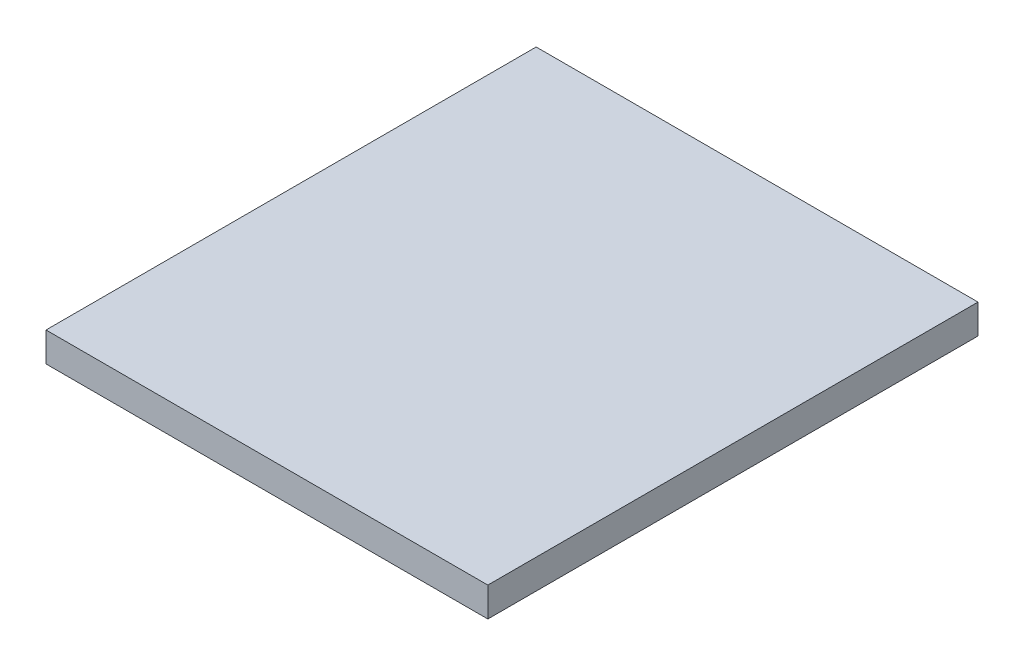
ISO-10303-21;
HEADER;
FILE_DESCRIPTION(('STEP AP214'),'2;1');
FILE_NAME('part.step','',(''),(''),'','','');
FILE_SCHEMA(('AUTOMOTIVE_DESIGN { 1 0 10303 214 1 1 1 1 }'));
ENDSEC;
DATA;
#1=APPLICATION_CONTEXT('core data for automotive mechanical design processes');
#2=APPLICATION_PROTOCOL_DEFINITION('international standard','automotive_design',2000,#1);
#3=PRODUCT_CONTEXT('',#1,'mechanical');
#4=PRODUCT('Part','Part','',(#3));
#5=PRODUCT_RELATED_PRODUCT_CATEGORY('part','',(#4));
#6=PRODUCT_DEFINITION_FORMATION('','',#4);
#7=PRODUCT_DEFINITION_CONTEXT('part definition',#1,'design');
#8=PRODUCT_DEFINITION('design','',#6,#7);
#9=PRODUCT_DEFINITION_SHAPE('','',#8);
#10=(LENGTH_UNIT() NAMED_UNIT(*) SI_UNIT(.MILLI.,.METRE.));
#11=(NAMED_UNIT(*) PLANE_ANGLE_UNIT() SI_UNIT($,.RADIAN.));
#12=(NAMED_UNIT(*) SI_UNIT($,.STERADIAN.) SOLID_ANGLE_UNIT());
#13=UNCERTAINTY_MEASURE_WITH_UNIT(LENGTH_MEASURE(1.E-05),#10,'distance_accuracy_value','');
#14=(GEOMETRIC_REPRESENTATION_CONTEXT(3) GLOBAL_UNCERTAINTY_ASSIGNED_CONTEXT((#13)) GLOBAL_UNIT_ASSIGNED_CONTEXT((#10,
#11,#12)) REPRESENTATION_CONTEXT('',''));
#15=CARTESIAN_POINT('',(0.,0.,0.));
#16=DIRECTION('',(0.,0.,1.));
#17=DIRECTION('',(1.,0.,0.));
#18=AXIS2_PLACEMENT_3D('',#15,#16,#17);
#19=CARTESIAN_POINT('',(1.93141652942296,6.,50.));
#20=DIRECTION('',(0.,0.,1.));
#21=DIRECTION('',(0.,1.,0.));
#22=AXIS2_PLACEMENT_3D('',#19,#20,#21);
#23=PLANE('',#22);
#24=DIRECTION('',(1.,0.,0.));
#25=VECTOR('',#24,1.);
#26=CARTESIAN_POINT('',(-20.068583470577,0.,50.));
#27=LINE('',#26,#25);
#28=CARTESIAN_POINT('',(-20.068583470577,0.,50.));
#29=VERTEX_POINT('',#28);
#30=CARTESIAN_POINT('',(25.,0.,50.));
#31=VERTEX_POINT('',#30);
#32=EDGE_CURVE('E67',#29,#31,#27,.T.);
#33=ORIENTED_EDGE('',*,*,#32,.T.);
#34=DIRECTION('',(0.,-1.,0.));
#35=VECTOR('',#34,1.);
#36=CARTESIAN_POINT('',(25.,3.,50.));
#37=LINE('',#36,#35);
#38=CARTESIAN_POINT('',(25.,3.,50.));
#39=VERTEX_POINT('',#38);
#40=EDGE_CURVE('E90',#39,#31,#37,.T.);
#41=ORIENTED_EDGE('',*,*,#40,.F.);
#42=DIRECTION('',(1.,0.,0.));
#43=VECTOR('',#42,1.);
#44=CARTESIAN_POINT('',(-20.068583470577,3.,50.));
#45=LINE('',#44,#43);
#46=CARTESIAN_POINT('',(-20.068583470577,3.,50.));
#47=VERTEX_POINT('',#46);
#48=EDGE_CURVE('E79',#47,#39,#45,.T.);
#49=ORIENTED_EDGE('',*,*,#48,.F.);
#50=DIRECTION('',(0.,1.,0.));
#51=VECTOR('',#50,1.);
#52=CARTESIAN_POINT('',(-20.068583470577,0.,50.));
#53=LINE('',#52,#51);
#54=EDGE_CURVE('E83',#29,#47,#53,.T.);
#55=ORIENTED_EDGE('',*,*,#54,.F.);
#56=EDGE_LOOP('',(#33,#41,#49,#55));
#57=FACE_BOUND('',#56,.T.);
#58=ADVANCED_FACE('F37',(#57),#23,.T.);
#59=CARTESIAN_POINT('',(0.,3.,50.));
#60=DIRECTION('',(0.,1.,0.));
#61=DIRECTION('',(0.,0.,1.));
#62=AXIS2_PLACEMENT_3D('',#59,#60,#61);
#63=PLANE('',#62);
#64=DIRECTION('',(1.,0.,0.));
#65=VECTOR('',#64,1.);
#66=CARTESIAN_POINT('',(-20.068583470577,3.,0.));
#67=LINE('',#66,#65);
#68=CARTESIAN_POINT('',(-20.068583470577,3.,0.));
#69=VERTEX_POINT('',#68);
#70=CARTESIAN_POINT('',(25.,3.,0.));
#71=VERTEX_POINT('',#70);
#72=EDGE_CURVE('E100',#69,#71,#67,.T.);
#73=ORIENTED_EDGE('',*,*,#72,.F.);
#74=DIRECTION('',(0.,0.,-1.));
#75=VECTOR('',#74,1.);
#76=CARTESIAN_POINT('',(-20.068583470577,3.,50.));
#77=LINE('',#76,#75);
#78=EDGE_CURVE('E12',#47,#69,#77,.T.);
#79=ORIENTED_EDGE('',*,*,#78,.F.);
#80=ORIENTED_EDGE('',*,*,#48,.T.);
#81=DIRECTION('',(0.,0.,-1.));
#82=VECTOR('',#81,1.);
#83=CARTESIAN_POINT('',(25.,3.,50.));
#84=LINE('',#83,#82);
#85=EDGE_CURVE('E81',#39,#71,#84,.T.);
#86=ORIENTED_EDGE('',*,*,#85,.T.);
#87=EDGE_LOOP('',(#73,#79,#80,#86));
#88=FACE_BOUND('',#87,.T.);
#89=ADVANCED_FACE('F39',(#88),#63,.T.);
#90=CARTESIAN_POINT('',(-20.068583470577,0.,50.));
#91=DIRECTION('',(-1.,0.,0.));
#92=DIRECTION('',(0.,0.,1.));
#93=AXIS2_PLACEMENT_3D('',#90,#91,#92);
#94=PLANE('',#93);
#95=DIRECTION('',(0.,1.,0.));
#96=VECTOR('',#95,1.);
#97=CARTESIAN_POINT('',(-20.068583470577,0.,0.));
#98=LINE('',#97,#96);
#99=CARTESIAN_POINT('',(-20.068583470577,0.,0.));
#100=VERTEX_POINT('',#99);
#101=EDGE_CURVE('E102',#100,#69,#98,.T.);
#102=ORIENTED_EDGE('',*,*,#101,.F.);
#103=DIRECTION('',(0.,0.,-1.));
#104=VECTOR('',#103,1.);
#105=CARTESIAN_POINT('',(-20.068583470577,0.,50.));
#106=LINE('',#105,#104);
#107=EDGE_CURVE('E46',#29,#100,#106,.T.);
#108=ORIENTED_EDGE('',*,*,#107,.F.);
#109=ORIENTED_EDGE('',*,*,#54,.T.);
#110=ORIENTED_EDGE('',*,*,#78,.T.);
#111=EDGE_LOOP('',(#102,#108,#109,#110));
#112=FACE_BOUND('',#111,.T.);
#113=ADVANCED_FACE('F110',(#112),#94,.T.);
#114=CARTESIAN_POINT('',(-20.068583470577,0.,50.));
#115=DIRECTION('',(0.,1.,0.));
#116=DIRECTION('',(-1.,0.,0.));
#117=AXIS2_PLACEMENT_3D('',#114,#115,#116);
#118=PLANE('',#117);
#119=DIRECTION('',(1.,0.,0.));
#120=VECTOR('',#119,1.);
#121=CARTESIAN_POINT('',(-20.068583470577,0.,0.));
#122=LINE('',#121,#120);
#123=CARTESIAN_POINT('',(25.,0.,0.));
#124=VERTEX_POINT('',#123);
#125=EDGE_CURVE('E84',#100,#124,#122,.T.);
#126=ORIENTED_EDGE('',*,*,#125,.T.);
#127=DIRECTION('',(0.,0.,-1.));
#128=VECTOR('',#127,1.);
#129=CARTESIAN_POINT('',(25.,0.,50.));
#130=LINE('',#129,#128);
#131=EDGE_CURVE('E93',#31,#124,#130,.T.);
#132=ORIENTED_EDGE('',*,*,#131,.F.);
#133=ORIENTED_EDGE('',*,*,#32,.F.);
#134=ORIENTED_EDGE('',*,*,#107,.T.);
#135=EDGE_LOOP('',(#126,#132,#133,#134));
#136=FACE_BOUND('',#135,.T.);
#137=ADVANCED_FACE('F107',(#136),#118,.F.);
#138=CARTESIAN_POINT('',(-1.06858347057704,6.,0.));
#139=DIRECTION('',(0.,0.,1.));
#140=DIRECTION('',(0.,1.,0.));
#141=AXIS2_PLACEMENT_3D('',#138,#139,#140);
#142=PLANE('',#141);
#143=ORIENTED_EDGE('',*,*,#72,.T.);
#144=DIRECTION('',(0.,-1.,0.));
#145=VECTOR('',#144,1.);
#146=CARTESIAN_POINT('',(25.,3.,0.));
#147=LINE('',#146,#145);
#148=EDGE_CURVE('E92',#71,#124,#147,.T.);
#149=ORIENTED_EDGE('',*,*,#148,.T.);
#150=ORIENTED_EDGE('',*,*,#125,.F.);
#151=ORIENTED_EDGE('',*,*,#101,.T.);
#152=EDGE_LOOP('',(#143,#149,#150,#151));
#153=FACE_BOUND('',#152,.T.);
#154=ADVANCED_FACE('F109',(#153),#142,.F.);
#155=CARTESIAN_POINT('',(25.,3.,50.));
#156=DIRECTION('',(1.,0.,0.));
#157=DIRECTION('',(0.,0.,-1.));
#158=AXIS2_PLACEMENT_3D('',#155,#156,#157);
#159=PLANE('',#158);
#160=ORIENTED_EDGE('',*,*,#148,.F.);
#161=ORIENTED_EDGE('',*,*,#85,.F.);
#162=ORIENTED_EDGE('',*,*,#40,.T.);
#163=ORIENTED_EDGE('',*,*,#131,.T.);
#164=EDGE_LOOP('',(#160,#161,#162,#163));
#165=FACE_BOUND('',#164,.T.);
#166=ADVANCED_FACE('F88',(#165),#159,.T.);
#167=CLOSED_SHELL('',(#58,#89,#113,#137,#154,#166));
#168=MANIFOLD_SOLID_BREP('B2',#167);
#169=ADVANCED_BREP_SHAPE_REPRESENTATION('',(#18,#168),#14);
#170=SHAPE_DEFINITION_REPRESENTATION(#9,#169);
ENDSEC;
END-ISO-10303-21;
